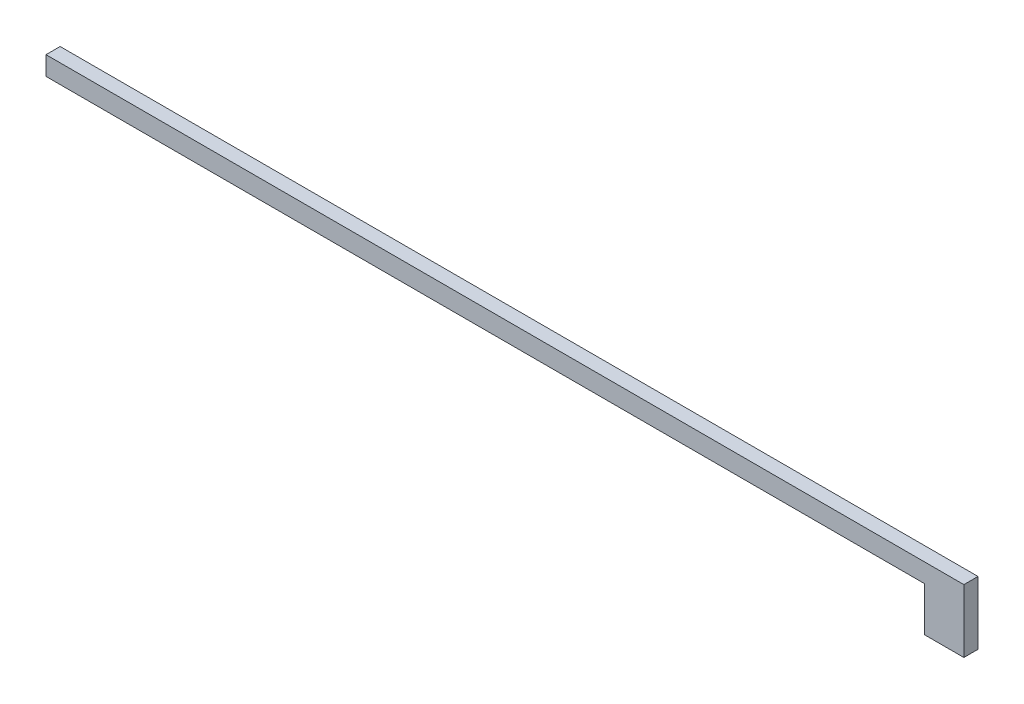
ISO-10303-21;
HEADER;
FILE_DESCRIPTION(('STEP AP214'),'2;1');
FILE_NAME('part.step','',(''),(''),'','','');
FILE_SCHEMA(('AUTOMOTIVE_DESIGN { 1 0 10303 214 1 1 1 1 }'));
ENDSEC;
DATA;
#1=APPLICATION_CONTEXT('core data for automotive mechanical design processes');
#2=APPLICATION_PROTOCOL_DEFINITION('international standard','automotive_design',2000,#1);
#3=PRODUCT_CONTEXT('',#1,'mechanical');
#4=PRODUCT('Part','Part','',(#3));
#5=PRODUCT_RELATED_PRODUCT_CATEGORY('part','',(#4));
#6=PRODUCT_DEFINITION_FORMATION('','',#4);
#7=PRODUCT_DEFINITION_CONTEXT('part definition',#1,'design');
#8=PRODUCT_DEFINITION('design','',#6,#7);
#9=PRODUCT_DEFINITION_SHAPE('','',#8);
#10=(LENGTH_UNIT() NAMED_UNIT(*) SI_UNIT(.MILLI.,.METRE.));
#11=(NAMED_UNIT(*) PLANE_ANGLE_UNIT() SI_UNIT($,.RADIAN.));
#12=(NAMED_UNIT(*) SI_UNIT($,.STERADIAN.) SOLID_ANGLE_UNIT());
#13=UNCERTAINTY_MEASURE_WITH_UNIT(LENGTH_MEASURE(1.E-05),#10,'distance_accuracy_value','');
#14=(GEOMETRIC_REPRESENTATION_CONTEXT(3) GLOBAL_UNCERTAINTY_ASSIGNED_CONTEXT((#13)) GLOBAL_UNIT_ASSIGNED_CONTEXT((#10,
#11,#12)) REPRESENTATION_CONTEXT('',''));
#15=CARTESIAN_POINT('',(0.,0.,0.));
#16=DIRECTION('',(0.,0.,1.));
#17=DIRECTION('',(1.,0.,0.));
#18=AXIS2_PLACEMENT_3D('',#15,#16,#17);
#19=CARTESIAN_POINT('',(-122.621316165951,24.3843633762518,3.81));
#20=DIRECTION('',(1.,0.,0.));
#21=DIRECTION('',(0.,0.,-1.));
#22=AXIS2_PLACEMENT_3D('',#19,#20,#21);
#23=PLANE('',#22);
#24=DIRECTION('',(0.,-1.,0.));
#25=VECTOR('',#24,1.);
#26=CARTESIAN_POINT('',(-122.621316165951,24.3843633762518,0.));
#27=LINE('',#26,#25);
#28=CARTESIAN_POINT('',(-122.621316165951,24.3843633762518,0.));
#29=VERTEX_POINT('',#28);
#30=CARTESIAN_POINT('',(-122.621316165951,19.3043633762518,0.));
#31=VERTEX_POINT('',#30);
#32=EDGE_CURVE('E87',#29,#31,#27,.T.);
#33=ORIENTED_EDGE('',*,*,#32,.T.);
#34=DIRECTION('',(0.,0.,-1.));
#35=VECTOR('',#34,1.);
#36=CARTESIAN_POINT('',(-122.621316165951,19.3043633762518,3.81));
#37=LINE('',#36,#35);
#38=CARTESIAN_POINT('',(-122.621316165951,19.3043633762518,3.81));
#39=VERTEX_POINT('',#38);
#40=EDGE_CURVE('E11',#39,#31,#37,.T.);
#41=ORIENTED_EDGE('',*,*,#40,.F.);
#42=DIRECTION('',(0.,-1.,0.));
#43=VECTOR('',#42,1.);
#44=CARTESIAN_POINT('',(-122.621316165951,24.3843633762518,3.81));
#45=LINE('',#44,#43);
#46=CARTESIAN_POINT('',(-122.621316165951,24.3843633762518,3.81));
#47=VERTEX_POINT('',#46);
#48=EDGE_CURVE('E111',#47,#39,#45,.T.);
#49=ORIENTED_EDGE('',*,*,#48,.F.);
#50=DIRECTION('',(0.,0.,-1.));
#51=VECTOR('',#50,1.);
#52=CARTESIAN_POINT('',(-122.621316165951,24.3843633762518,3.81));
#53=LINE('',#52,#51);
#54=EDGE_CURVE('E100',#47,#29,#53,.T.);
#55=ORIENTED_EDGE('',*,*,#54,.T.);
#56=EDGE_LOOP('',(#33,#41,#49,#55));
#57=FACE_BOUND('',#56,.T.);
#58=ADVANCED_FACE('F31',(#57),#23,.F.);
#59=CARTESIAN_POINT('',(-122.621316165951,19.3043633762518,3.81));
#60=DIRECTION('',(0.,1.,0.));
#61=DIRECTION('',(0.,0.,1.));
#62=AXIS2_PLACEMENT_3D('',#59,#60,#61);
#63=PLANE('',#62);
#64=DIRECTION('',(1.,0.,0.));
#65=VECTOR('',#64,1.);
#66=CARTESIAN_POINT('',(-122.621316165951,19.3043633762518,0.));
#67=LINE('',#66,#65);
#68=CARTESIAN_POINT('',(114.106683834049,19.3043633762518,0.));
#69=VERTEX_POINT('',#68);
#70=EDGE_CURVE('E83',#31,#69,#67,.T.);
#71=ORIENTED_EDGE('',*,*,#70,.T.);
#72=DIRECTION('',(0.,0.,-1.));
#73=VECTOR('',#72,1.);
#74=CARTESIAN_POINT('',(114.106683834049,19.3043633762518,3.81));
#75=LINE('',#74,#73);
#76=CARTESIAN_POINT('',(114.106683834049,19.3043633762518,3.81));
#77=VERTEX_POINT('',#76);
#78=EDGE_CURVE('E38',#77,#69,#75,.T.);
#79=ORIENTED_EDGE('',*,*,#78,.F.);
#80=DIRECTION('',(1.,0.,0.));
#81=VECTOR('',#80,1.);
#82=CARTESIAN_POINT('',(-122.621316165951,19.3043633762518,3.81));
#83=LINE('',#82,#81);
#84=EDGE_CURVE('E96',#39,#77,#83,.T.);
#85=ORIENTED_EDGE('',*,*,#84,.F.);
#86=ORIENTED_EDGE('',*,*,#40,.T.);
#87=EDGE_LOOP('',(#71,#79,#85,#86));
#88=FACE_BOUND('',#87,.T.);
#89=ADVANCED_FACE('F95',(#88),#63,.F.);
#90=CARTESIAN_POINT('',(114.106683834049,19.3043633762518,3.81));
#91=DIRECTION('',(1.,0.,0.));
#92=DIRECTION('',(0.,0.,-1.));
#93=AXIS2_PLACEMENT_3D('',#90,#91,#92);
#94=PLANE('',#93);
#95=DIRECTION('',(0.,-1.,0.));
#96=VECTOR('',#95,1.);
#97=CARTESIAN_POINT('',(114.106683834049,19.3043633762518,0.));
#98=LINE('',#97,#96);
#99=CARTESIAN_POINT('',(114.106683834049,7.36636337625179,0.));
#100=VERTEX_POINT('',#99);
#101=EDGE_CURVE('E89',#69,#100,#98,.T.);
#102=ORIENTED_EDGE('',*,*,#101,.T.);
#103=DIRECTION('',(0.,0.,-1.));
#104=VECTOR('',#103,1.);
#105=CARTESIAN_POINT('',(114.106683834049,7.36636337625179,3.81));
#106=LINE('',#105,#104);
#107=CARTESIAN_POINT('',(114.106683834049,7.36636337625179,3.81));
#108=VERTEX_POINT('',#107);
#109=EDGE_CURVE('E127',#108,#100,#106,.T.);
#110=ORIENTED_EDGE('',*,*,#109,.F.);
#111=DIRECTION('',(0.,-1.,0.));
#112=VECTOR('',#111,1.);
#113=CARTESIAN_POINT('',(114.106683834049,19.3043633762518,3.81));
#114=LINE('',#113,#112);
#115=EDGE_CURVE('E114',#77,#108,#114,.T.);
#116=ORIENTED_EDGE('',*,*,#115,.F.);
#117=ORIENTED_EDGE('',*,*,#78,.T.);
#118=EDGE_LOOP('',(#102,#110,#116,#117));
#119=FACE_BOUND('',#118,.T.);
#120=ADVANCED_FACE('F131',(#119),#94,.F.);
#121=CARTESIAN_POINT('',(114.106683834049,7.36636337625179,3.81));
#122=DIRECTION('',(0.,1.,0.));
#123=DIRECTION('',(0.,0.,1.));
#124=AXIS2_PLACEMENT_3D('',#121,#122,#123);
#125=PLANE('',#124);
#126=DIRECTION('',(1.,0.,0.));
#127=VECTOR('',#126,1.);
#128=CARTESIAN_POINT('',(114.106683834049,7.36636337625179,0.));
#129=LINE('',#128,#127);
#130=CARTESIAN_POINT('',(124.774683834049,7.36636337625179,0.));
#131=VERTEX_POINT('',#130);
#132=EDGE_CURVE('E104',#100,#131,#129,.T.);
#133=ORIENTED_EDGE('',*,*,#132,.T.);
#134=DIRECTION('',(0.,0.,-1.));
#135=VECTOR('',#134,1.);
#136=CARTESIAN_POINT('',(124.774683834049,7.36636337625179,3.81));
#137=LINE('',#136,#135);
#138=CARTESIAN_POINT('',(124.774683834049,7.36636337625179,3.81));
#139=VERTEX_POINT('',#138);
#140=EDGE_CURVE('E124',#139,#131,#137,.T.);
#141=ORIENTED_EDGE('',*,*,#140,.F.);
#142=DIRECTION('',(1.,0.,0.));
#143=VECTOR('',#142,1.);
#144=CARTESIAN_POINT('',(114.106683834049,7.36636337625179,3.81));
#145=LINE('',#144,#143);
#146=EDGE_CURVE('E116',#108,#139,#145,.T.);
#147=ORIENTED_EDGE('',*,*,#146,.F.);
#148=ORIENTED_EDGE('',*,*,#109,.T.);
#149=EDGE_LOOP('',(#133,#141,#147,#148));
#150=FACE_BOUND('',#149,.T.);
#151=ADVANCED_FACE('F137',(#150),#125,.F.);
#152=CARTESIAN_POINT('',(124.774683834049,24.3843633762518,3.81));
#153=DIRECTION('',(-1.,0.,0.));
#154=DIRECTION('',(0.,0.,1.));
#155=AXIS2_PLACEMENT_3D('',#152,#153,#154);
#156=PLANE('',#155);
#157=DIRECTION('',(0.,1.,0.));
#158=VECTOR('',#157,1.);
#159=CARTESIAN_POINT('',(124.774683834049,24.3843633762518,0.));
#160=LINE('',#159,#158);
#161=CARTESIAN_POINT('',(124.774683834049,24.3843633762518,0.));
#162=VERTEX_POINT('',#161);
#163=EDGE_CURVE('E107',#131,#162,#160,.T.);
#164=ORIENTED_EDGE('',*,*,#163,.T.);
#165=DIRECTION('',(0.,0.,-1.));
#166=VECTOR('',#165,1.);
#167=CARTESIAN_POINT('',(124.774683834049,24.3843633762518,3.81));
#168=LINE('',#167,#166);
#169=CARTESIAN_POINT('',(124.774683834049,24.3843633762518,3.81));
#170=VERTEX_POINT('',#169);
#171=EDGE_CURVE('E121',#170,#162,#168,.T.);
#172=ORIENTED_EDGE('',*,*,#171,.F.);
#173=DIRECTION('',(0.,1.,0.));
#174=VECTOR('',#173,1.);
#175=CARTESIAN_POINT('',(124.774683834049,7.36636337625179,3.81));
#176=LINE('',#175,#174);
#177=EDGE_CURVE('E50',#139,#170,#176,.T.);
#178=ORIENTED_EDGE('',*,*,#177,.F.);
#179=ORIENTED_EDGE('',*,*,#140,.T.);
#180=EDGE_LOOP('',(#164,#172,#178,#179));
#181=FACE_BOUND('',#180,.T.);
#182=ADVANCED_FACE('F139',(#181),#156,.F.);
#183=CARTESIAN_POINT('',(-122.621316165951,24.3843633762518,3.81));
#184=DIRECTION('',(0.,-1.,0.));
#185=DIRECTION('',(0.,0.,-1.));
#186=AXIS2_PLACEMENT_3D('',#183,#184,#185);
#187=PLANE('',#186);
#188=DIRECTION('',(-1.,0.,0.));
#189=VECTOR('',#188,1.);
#190=CARTESIAN_POINT('',(-122.621316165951,24.3843633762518,0.));
#191=LINE('',#190,#189);
#192=EDGE_CURVE('E109',#162,#29,#191,.T.);
#193=ORIENTED_EDGE('',*,*,#192,.T.);
#194=ORIENTED_EDGE('',*,*,#54,.F.);
#195=DIRECTION('',(-1.,0.,0.));
#196=VECTOR('',#195,1.);
#197=CARTESIAN_POINT('',(-122.621316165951,24.3843633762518,3.81));
#198=LINE('',#197,#196);
#199=EDGE_CURVE('E45',#170,#47,#198,.T.);
#200=ORIENTED_EDGE('',*,*,#199,.F.);
#201=ORIENTED_EDGE('',*,*,#171,.T.);
#202=EDGE_LOOP('',(#193,#194,#200,#201));
#203=FACE_BOUND('',#202,.T.);
#204=ADVANCED_FACE('F141',(#203),#187,.F.);
#205=CARTESIAN_POINT('',(-122.621316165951,19.3043633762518,3.81));
#206=DIRECTION('',(0.,0.,1.));
#207=DIRECTION('',(1.,0.,0.));
#208=AXIS2_PLACEMENT_3D('',#205,#206,#207);
#209=PLANE('',#208);
#210=ORIENTED_EDGE('',*,*,#48,.T.);
#211=ORIENTED_EDGE('',*,*,#84,.T.);
#212=ORIENTED_EDGE('',*,*,#115,.T.);
#213=ORIENTED_EDGE('',*,*,#146,.T.);
#214=ORIENTED_EDGE('',*,*,#177,.T.);
#215=ORIENTED_EDGE('',*,*,#199,.T.);
#216=EDGE_LOOP('',(#210,#211,#212,#213,#214,#215));
#217=FACE_BOUND('',#216,.T.);
#218=ADVANCED_FACE('F134',(#217),#209,.T.);
#219=CARTESIAN_POINT('',(-122.621316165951,19.3043633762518,0.));
#220=DIRECTION('',(0.,0.,1.));
#221=DIRECTION('',(1.,0.,0.));
#222=AXIS2_PLACEMENT_3D('',#219,#220,#221);
#223=PLANE('',#222);
#224=ORIENTED_EDGE('',*,*,#32,.F.);
#225=ORIENTED_EDGE('',*,*,#192,.F.);
#226=ORIENTED_EDGE('',*,*,#163,.F.);
#227=ORIENTED_EDGE('',*,*,#132,.F.);
#228=ORIENTED_EDGE('',*,*,#101,.F.);
#229=ORIENTED_EDGE('',*,*,#70,.F.);
#230=EDGE_LOOP('',(#224,#225,#226,#227,#228,#229));
#231=FACE_BOUND('',#230,.T.);
#232=ADVANCED_FACE('F84',(#231),#223,.F.);
#233=CLOSED_SHELL('',(#58,#89,#120,#151,#182,#204,#218,#232));
#234=MANIFOLD_SOLID_BREP('B2',#233);
#235=ADVANCED_BREP_SHAPE_REPRESENTATION('',(#18,#234),#14);
#236=SHAPE_DEFINITION_REPRESENTATION(#9,#235);
ENDSEC;
END-ISO-10303-21;
